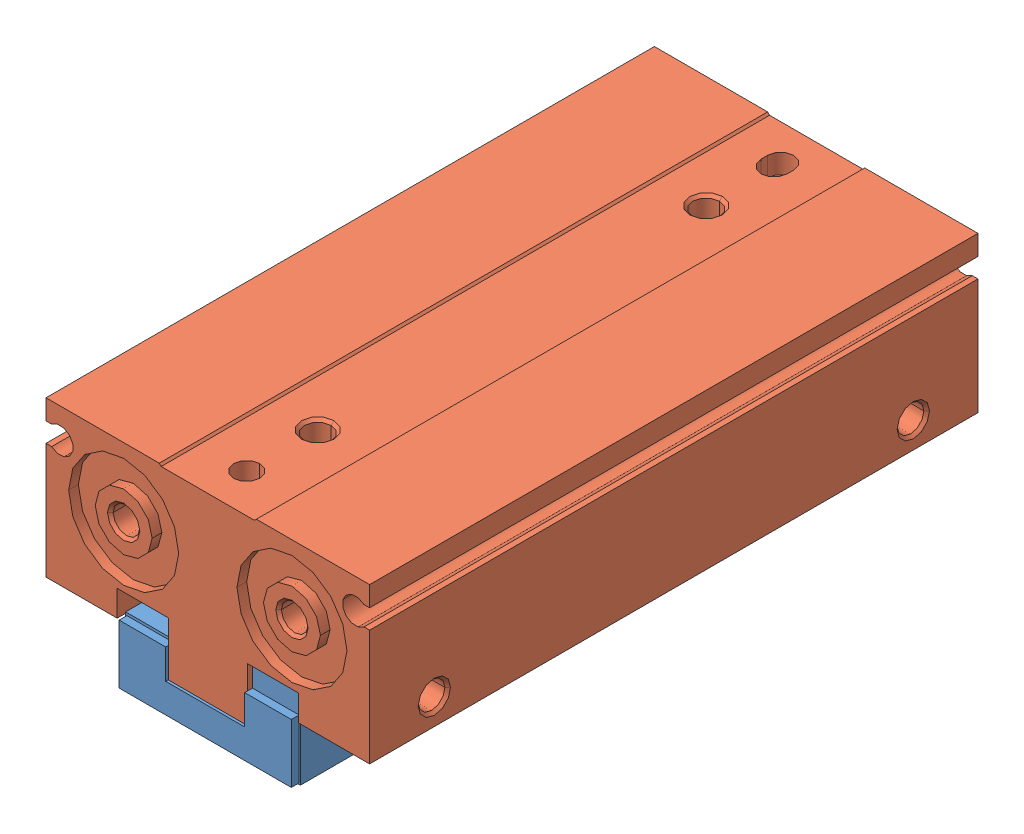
SolidWorks assembly SHF16-32.sldasm, configuration Default (file format 11000). Lengths in mm.
Overall size (50 33 94.8).
3 component instances, 2 part files, 0 mates.
Components (placement in the parent):
- SHF16-32-1-1: SHF16-32-1.sldprt [Default] at (0 -33 16) size (27 14.6 60.3)
- SHF16-32-1-2: SHF16-32-1.sldprt [Default] at (0 -33 -16) x (-1 0 0) z (0 0 -1) size (27 14.6 60.3)
- SHF16-32-2-1: SHF16-32-2.sldprt [Default] at origin size (50 28.3 94)
